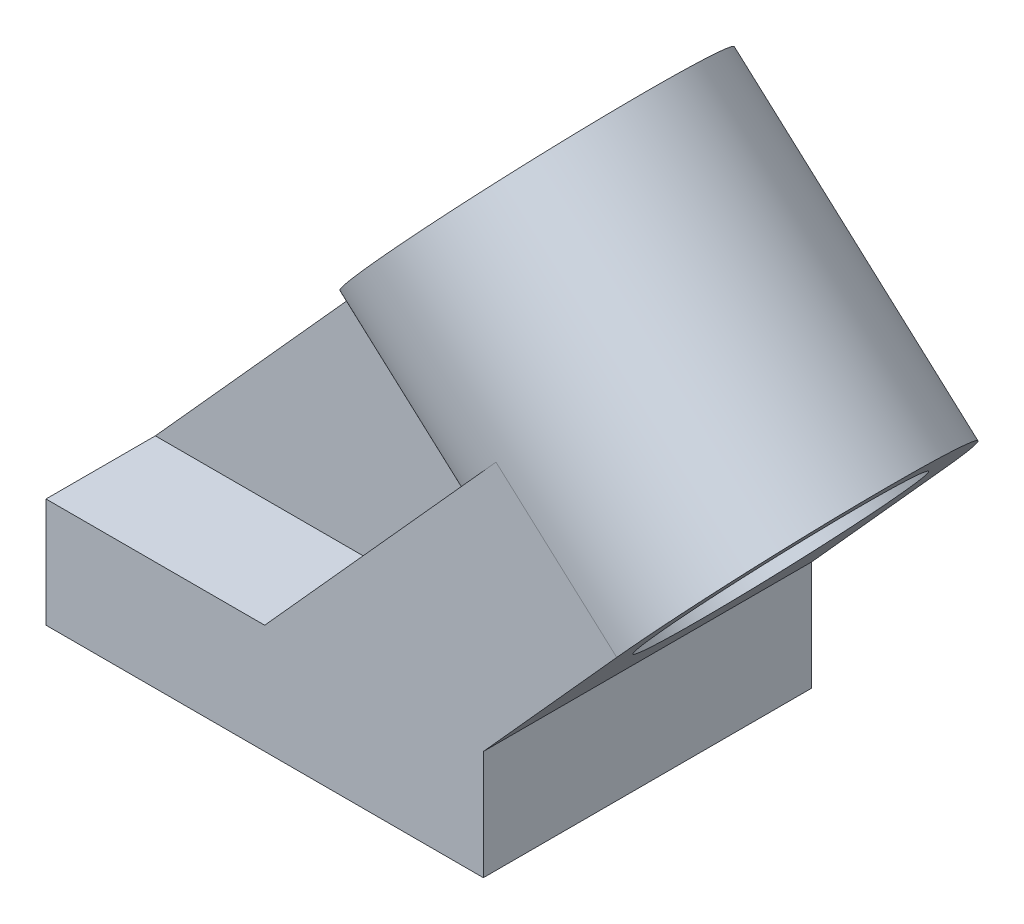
from build123d import *

# Parameters (mm, degrees)
BOSS_EXTRUDE1_DEPTH = 76.2
SKETCH2_R           = 38.1
BOSS_EXTRUDE2_DEPTH = 76.2
SKETCH3_R           = 28.575
CUT_EXTRUDE1_DEPTH  = 227.557457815
RIB1_REACH          = 216.003
SKETCH4_WALL_W      = 506.206497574
SKETCH4_WALL_H      = 25.4


with BuildPart() as part:
    # Sketch1 → Boss-Extrude1 (new body)
    with BuildSketch(Plane.XY):
        Polygon((0, 0), (101.6, 0), (101.6, 25.4), (132.591674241, 59.819741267), (104.536651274, 85.08059741), (50.8, 25.4), (0, 25.4), align=None)
    extrude(amount=BOSS_EXTRUDE1_DEPTH)

    # Sketch2 → Boss-Extrude2 (add)
    with BuildSketch(Plane(origin=(43.479617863, -39.149223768, 0), x_dir=(0, 0, -1), z_dir=(0.7431448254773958, -0.6691306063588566, 0))):
        with Locations(Location((-38.1, 133.175878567, 0), (0, 0, 90))):
            Circle(SKETCH2_R)
    extrude(amount=-BOSS_EXTRUDE2_DEPTH)

    # Sketch3 → Cut-Extrude1 (cut, through all)
    with BuildSketch(Plane(origin=(-13.148017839, 11.838528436, 0), x_dir=(0, 0, 1), z_dir=(-0.7431448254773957, 0.6691306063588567, 0))):
        with Locations(Location((38.1, 133.175878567, 0), (0, 0, 270))):
            Circle(SKETCH3_R)
    extrude(amount=-CUT_EXTRUDE1_DEPTH, mode=Mode.SUBTRACT)

    # Sketch4 wall → Rib1 (add, up to next)
    with BuildSketch(Plane(origin=(25.493876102, 53.71381785, 38.1), x_dir=(0.669130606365, 0.743144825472, 0), z_dir=(-0.743144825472, 0.669130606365, 0)), mode=Mode.PRIVATE) as rib1_sk1:
        Rectangle(SKETCH4_WALL_W, SKETCH4_WALL_H)
    rib1_tool1 = extrude(rib1_sk1.sketch, amount=-RIB1_REACH, mode=Mode.PRIVATE) - part.part
    add(rib1_tool1.solids().sort_by_distance((25.493876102, 53.71381785, 38.1))[0])


solid = part.part
